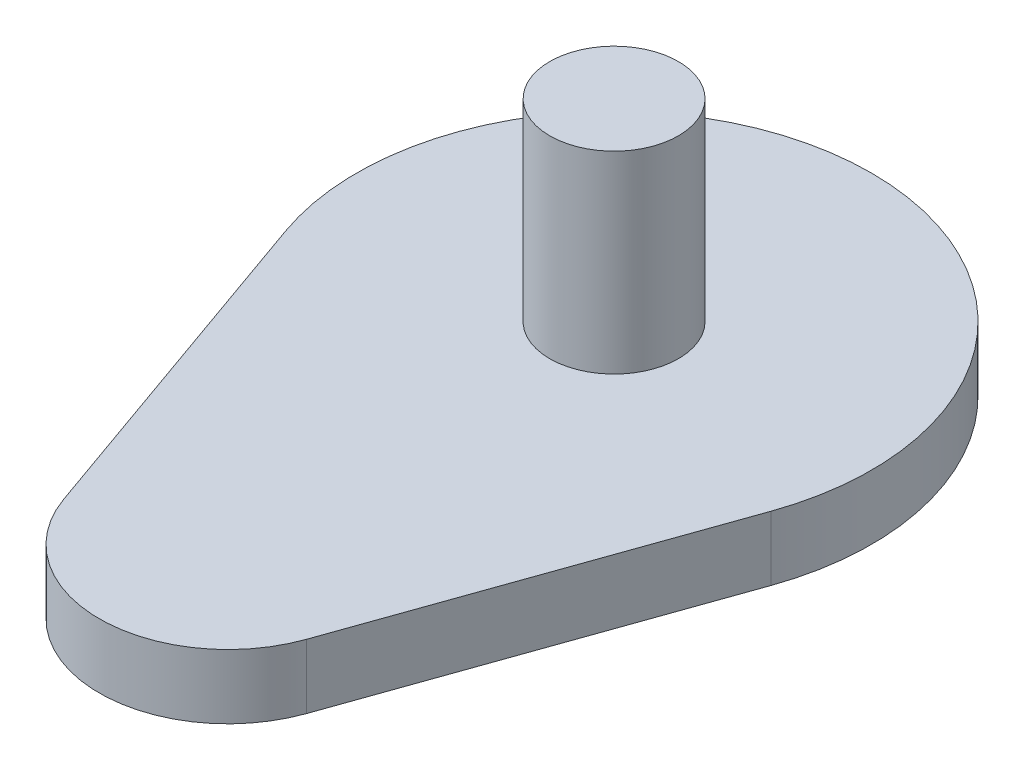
ISO-10303-21;
HEADER;
FILE_DESCRIPTION(('STEP AP214'),'2;1');
FILE_NAME('part.step','',(''),(''),'','','');
FILE_SCHEMA(('AUTOMOTIVE_DESIGN { 1 0 10303 214 1 1 1 1 }'));
ENDSEC;
DATA;
#1=APPLICATION_CONTEXT('core data for automotive mechanical design processes');
#2=APPLICATION_PROTOCOL_DEFINITION('international standard','automotive_design',2000,#1);
#3=PRODUCT_CONTEXT('',#1,'mechanical');
#4=PRODUCT('Part','Part','',(#3));
#5=PRODUCT_RELATED_PRODUCT_CATEGORY('part','',(#4));
#6=PRODUCT_DEFINITION_FORMATION('','',#4);
#7=PRODUCT_DEFINITION_CONTEXT('part definition',#1,'design');
#8=PRODUCT_DEFINITION('design','',#6,#7);
#9=PRODUCT_DEFINITION_SHAPE('','',#8);
#10=(LENGTH_UNIT() NAMED_UNIT(*) SI_UNIT(.MILLI.,.METRE.));
#11=(NAMED_UNIT(*) PLANE_ANGLE_UNIT() SI_UNIT($,.RADIAN.));
#12=(NAMED_UNIT(*) SI_UNIT($,.STERADIAN.) SOLID_ANGLE_UNIT());
#13=UNCERTAINTY_MEASURE_WITH_UNIT(LENGTH_MEASURE(1.E-05),#10,'distance_accuracy_value','');
#14=(GEOMETRIC_REPRESENTATION_CONTEXT(3) GLOBAL_UNCERTAINTY_ASSIGNED_CONTEXT((#13)) GLOBAL_UNIT_ASSIGNED_CONTEXT((#10,
#11,#12)) REPRESENTATION_CONTEXT('',''));
#15=CARTESIAN_POINT('',(0.,0.,0.));
#16=DIRECTION('',(0.,0.,1.));
#17=DIRECTION('',(1.,0.,0.));
#18=AXIS2_PLACEMENT_3D('',#15,#16,#17);
#19=CARTESIAN_POINT('',(0.,-19.142135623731,0.));
#20=DIRECTION('',(0.,1.,0.));
#21=DIRECTION('',(0.,0.,1.));
#22=AXIS2_PLACEMENT_3D('',#19,#20,#21);
#23=CYLINDRICAL_SURFACE('',#22,5.);
#24=CARTESIAN_POINT('',(0.,-5.,0.));
#25=DIRECTION('',(0.,1.,0.));
#26=DIRECTION('',(0.,0.,1.));
#27=AXIS2_PLACEMENT_3D('',#24,#25,#26);
#28=CIRCLE('',#27,5.);
#29=CARTESIAN_POINT('',(0.,-5.,5.));
#30=VERTEX_POINT('',#29);
#31=EDGE_CURVE('E11',#30,#30,#28,.F.);
#32=ORIENTED_EDGE('',*,*,#31,.F.);
#33=EDGE_LOOP('',(#32));
#34=FACE_BOUND('',#33,.T.);
#35=CARTESIAN_POINT('',(0.,15.,0.));
#36=DIRECTION('',(0.,1.,0.));
#37=DIRECTION('',(0.,0.,1.));
#38=AXIS2_PLACEMENT_3D('',#35,#36,#37);
#39=CIRCLE('',#38,5.);
#40=CARTESIAN_POINT('',(0.,15.,5.));
#41=VERTEX_POINT('',#40);
#42=EDGE_CURVE('E45',#41,#41,#39,.T.);
#43=ORIENTED_EDGE('',*,*,#42,.F.);
#44=EDGE_LOOP('',(#43));
#45=FACE_BOUND('',#44,.T.);
#46=ADVANCED_FACE('F39',(#34,#45),#23,.T.);
#47=CARTESIAN_POINT('',(0.,-5.,0.));
#48=DIRECTION('',(0.,1.,0.));
#49=DIRECTION('',(0.,0.,1.));
#50=AXIS2_PLACEMENT_3D('',#47,#48,#49);
#51=PLANE('',#50);
#52=ORIENTED_EDGE('',*,*,#31,.T.);
#53=EDGE_LOOP('',(#52));
#54=FACE_BOUND('',#53,.T.);
#55=ADVANCED_FACE('F54',(#54),#51,.F.);
#56=CARTESIAN_POINT('',(-56.230636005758,15.,9.99999999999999));
#57=DIRECTION('',(0.,1.,0.));
#58=DIRECTION('',(0.,0.,1.));
#59=AXIS2_PLACEMENT_3D('',#56,#57,#58);
#60=PLANE('',#59);
#61=ORIENTED_EDGE('',*,*,#42,.T.);
#62=EDGE_LOOP('',(#61));
#63=FACE_BOUND('',#62,.T.);
#64=ADVANCED_FACE('F51',(#63),#60,.T.);
#65=CLOSED_SHELL('',(#46,#55,#64));
#66=MANIFOLD_SOLID_BREP('B2',#65);
#67=CARTESIAN_POINT('',(0.,-5.,0.));
#68=DIRECTION('',(0.,1.,0.));
#69=DIRECTION('',(0.,0.,1.));
#70=AXIS2_PLACEMENT_3D('',#67,#68,#69);
#71=CYLINDRICAL_SURFACE('',#70,20.);
#72=CARTESIAN_POINT('',(0.,0.,0.));
#73=DIRECTION('',(0.,1.,0.));
#74=DIRECTION('',(0.,0.,1.));
#75=AXIS2_PLACEMENT_3D('',#72,#73,#74);
#76=CIRCLE('',#75,20.);
#77=CARTESIAN_POINT('',(18.8561808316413,0.,6.66666666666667));
#78=VERTEX_POINT('',#77);
#79=CARTESIAN_POINT('',(-18.8561808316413,0.,6.66666666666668));
#80=VERTEX_POINT('',#79);
#81=EDGE_CURVE('E145',#78,#80,#76,.T.);
#82=ORIENTED_EDGE('',*,*,#81,.F.);
#83=DIRECTION('',(0.,1.,0.));
#84=VECTOR('',#83,1.);
#85=CARTESIAN_POINT('',(18.8561808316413,-5.,6.66666666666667));
#86=LINE('',#85,#84);
#87=CARTESIAN_POINT('',(18.8561808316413,-5.,6.66666666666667));
#88=VERTEX_POINT('',#87);
#89=EDGE_CURVE('E37',#88,#78,#86,.T.);
#90=ORIENTED_EDGE('',*,*,#89,.F.);
#91=CARTESIAN_POINT('',(0.,-5.,0.));
#92=DIRECTION('',(0.,1.,0.));
#93=DIRECTION('',(0.,0.,1.));
#94=AXIS2_PLACEMENT_3D('',#91,#92,#93);
#95=CIRCLE('',#94,20.);
#96=CARTESIAN_POINT('',(-18.8561808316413,-5.,6.66666666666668));
#97=VERTEX_POINT('',#96);
#98=EDGE_CURVE('E138',#88,#97,#95,.T.);
#99=ORIENTED_EDGE('',*,*,#98,.T.);
#100=DIRECTION('',(0.,1.,0.));
#101=VECTOR('',#100,1.);
#102=CARTESIAN_POINT('',(-18.8561808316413,-5.,6.66666666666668));
#103=LINE('',#102,#101);
#104=EDGE_CURVE('E83',#97,#80,#103,.T.);
#105=ORIENTED_EDGE('',*,*,#104,.T.);
#106=EDGE_LOOP('',(#82,#90,#99,#105));
#107=FACE_BOUND('',#106,.T.);
#108=ADVANCED_FACE('F80',(#107),#71,.T.);
#109=CARTESIAN_POINT('',(18.8561808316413,-5.,6.66666666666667));
#110=DIRECTION('',(0.942809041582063,0.,0.333333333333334));
#111=DIRECTION('',(0.333333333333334,0.,-0.942809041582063));
#112=AXIS2_PLACEMENT_3D('',#109,#110,#111);
#113=PLANE('',#112);
#114=DIRECTION('',(0.333333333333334,0.,-0.942809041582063));
#115=VECTOR('',#114,1.);
#116=CARTESIAN_POINT('',(18.8561808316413,0.,6.66666666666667));
#117=LINE('',#116,#115);
#118=CARTESIAN_POINT('',(9.42809041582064,0.,33.3333333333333));
#119=VERTEX_POINT('',#118);
#120=EDGE_CURVE('E140',#119,#78,#117,.T.);
#121=ORIENTED_EDGE('',*,*,#120,.F.);
#122=DIRECTION('',(0.,1.,0.));
#123=VECTOR('',#122,1.);
#124=CARTESIAN_POINT('',(9.42809041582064,-5.,33.3333333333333));
#125=LINE('',#124,#123);
#126=CARTESIAN_POINT('',(9.42809041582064,-5.,33.3333333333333));
#127=VERTEX_POINT('',#126);
#128=EDGE_CURVE('E89',#127,#119,#125,.T.);
#129=ORIENTED_EDGE('',*,*,#128,.F.);
#130=DIRECTION('',(0.333333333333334,0.,-0.942809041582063));
#131=VECTOR('',#130,1.);
#132=CARTESIAN_POINT('',(18.8561808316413,-5.,6.66666666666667));
#133=LINE('',#132,#131);
#134=EDGE_CURVE('E135',#127,#88,#133,.T.);
#135=ORIENTED_EDGE('',*,*,#134,.T.);
#136=ORIENTED_EDGE('',*,*,#89,.T.);
#137=EDGE_LOOP('',(#121,#129,#135,#136));
#138=FACE_BOUND('',#137,.T.);
#139=ADVANCED_FACE('F156',(#138),#113,.T.);
#140=CARTESIAN_POINT('',(0.,-5.,30.));
#141=DIRECTION('',(0.,1.,0.));
#142=DIRECTION('',(0.,0.,1.));
#143=AXIS2_PLACEMENT_3D('',#140,#141,#142);
#144=CYLINDRICAL_SURFACE('',#143,10.);
#145=CARTESIAN_POINT('',(0.,0.,30.));
#146=DIRECTION('',(0.,1.,0.));
#147=DIRECTION('',(0.,0.,1.));
#148=AXIS2_PLACEMENT_3D('',#145,#146,#147);
#149=CIRCLE('',#148,10.);
#150=CARTESIAN_POINT('',(-9.42809041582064,0.,33.3333333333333));
#151=VERTEX_POINT('',#150);
#152=EDGE_CURVE('E130',#151,#119,#149,.T.);
#153=ORIENTED_EDGE('',*,*,#152,.F.);
#154=DIRECTION('',(0.,1.,0.));
#155=VECTOR('',#154,1.);
#156=CARTESIAN_POINT('',(-9.42809041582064,-5.,33.3333333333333));
#157=LINE('',#156,#155);
#158=CARTESIAN_POINT('',(-9.42809041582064,-5.,33.3333333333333));
#159=VERTEX_POINT('',#158);
#160=EDGE_CURVE('E125',#159,#151,#157,.T.);
#161=ORIENTED_EDGE('',*,*,#160,.F.);
#162=CARTESIAN_POINT('',(0.,-5.,30.));
#163=DIRECTION('',(0.,1.,0.));
#164=DIRECTION('',(0.,0.,1.));
#165=AXIS2_PLACEMENT_3D('',#162,#163,#164);
#166=CIRCLE('',#165,10.);
#167=EDGE_CURVE('E128',#159,#127,#166,.T.);
#168=ORIENTED_EDGE('',*,*,#167,.T.);
#169=ORIENTED_EDGE('',*,*,#128,.T.);
#170=EDGE_LOOP('',(#153,#161,#168,#169));
#171=FACE_BOUND('',#170,.T.);
#172=ADVANCED_FACE('F127',(#171),#144,.T.);
#173=CARTESIAN_POINT('',(-9.42809041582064,-5.,33.3333333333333));
#174=DIRECTION('',(-0.942809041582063,0.,0.333333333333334));
#175=DIRECTION('',(0.333333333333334,0.,0.942809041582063));
#176=AXIS2_PLACEMENT_3D('',#173,#174,#175);
#177=PLANE('',#176);
#178=DIRECTION('',(0.333333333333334,0.,0.942809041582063));
#179=VECTOR('',#178,1.);
#180=CARTESIAN_POINT('',(-9.42809041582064,0.,33.3333333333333));
#181=LINE('',#180,#179);
#182=EDGE_CURVE('E148',#80,#151,#181,.T.);
#183=ORIENTED_EDGE('',*,*,#182,.F.);
#184=ORIENTED_EDGE('',*,*,#104,.F.);
#185=DIRECTION('',(0.333333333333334,0.,0.942809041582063));
#186=VECTOR('',#185,1.);
#187=CARTESIAN_POINT('',(-9.42809041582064,-5.,33.3333333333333));
#188=LINE('',#187,#186);
#189=EDGE_CURVE('E134',#97,#159,#188,.T.);
#190=ORIENTED_EDGE('',*,*,#189,.T.);
#191=ORIENTED_EDGE('',*,*,#160,.T.);
#192=EDGE_LOOP('',(#183,#184,#190,#191));
#193=FACE_BOUND('',#192,.T.);
#194=ADVANCED_FACE('F137',(#193),#177,.T.);
#195=CARTESIAN_POINT('',(0.,-5.,0.));
#196=DIRECTION('',(0.,1.,0.));
#197=DIRECTION('',(0.,0.,1.));
#198=AXIS2_PLACEMENT_3D('',#195,#196,#197);
#199=PLANE('',#198);
#200=CARTESIAN_POINT('',(0.,-5.,0.));
#201=DIRECTION('',(0.,1.,0.));
#202=DIRECTION('',(0.,0.,1.));
#203=AXIS2_PLACEMENT_3D('',#200,#201,#202);
#204=CIRCLE('',#203,5.);
#205=CARTESIAN_POINT('',(0.,-5.,5.));
#206=VERTEX_POINT('',#205);
#207=EDGE_CURVE('E149',#206,#206,#204,.T.);
#208=ORIENTED_EDGE('',*,*,#207,.T.);
#209=EDGE_LOOP('',(#208));
#210=FACE_BOUND('',#209,.T.);
#211=ORIENTED_EDGE('',*,*,#98,.F.);
#212=ORIENTED_EDGE('',*,*,#134,.F.);
#213=ORIENTED_EDGE('',*,*,#167,.F.);
#214=ORIENTED_EDGE('',*,*,#189,.F.);
#215=EDGE_LOOP('',(#211,#212,#213,#214));
#216=FACE_BOUND('',#215,.T.);
#217=ADVANCED_FACE('F133',(#210,#216),#199,.F.);
#218=CARTESIAN_POINT('',(0.,0.,0.));
#219=DIRECTION('',(0.,1.,0.));
#220=DIRECTION('',(0.,0.,1.));
#221=AXIS2_PLACEMENT_3D('',#218,#219,#220);
#222=PLANE('',#221);
#223=CARTESIAN_POINT('',(0.,0.,0.));
#224=DIRECTION('',(0.,1.,0.));
#225=DIRECTION('',(0.,0.,1.));
#226=AXIS2_PLACEMENT_3D('',#223,#224,#225);
#227=CIRCLE('',#226,5.);
#228=CARTESIAN_POINT('',(0.,0.,5.));
#229=VERTEX_POINT('',#228);
#230=EDGE_CURVE('E186',#229,#229,#227,.T.);
#231=ORIENTED_EDGE('',*,*,#230,.F.);
#232=EDGE_LOOP('',(#231));
#233=FACE_BOUND('',#232,.T.);
#234=ORIENTED_EDGE('',*,*,#81,.T.);
#235=ORIENTED_EDGE('',*,*,#182,.T.);
#236=ORIENTED_EDGE('',*,*,#152,.T.);
#237=ORIENTED_EDGE('',*,*,#120,.T.);
#238=EDGE_LOOP('',(#234,#235,#236,#237));
#239=FACE_BOUND('',#238,.T.);
#240=ADVANCED_FACE('F155',(#233,#239),#222,.T.);
#241=CARTESIAN_POINT('',(0.,-5.,0.));
#242=DIRECTION('',(0.,1.,0.));
#243=DIRECTION('',(0.,0.,1.));
#244=AXIS2_PLACEMENT_3D('',#241,#242,#243);
#245=CYLINDRICAL_SURFACE('',#244,5.);
#246=ORIENTED_EDGE('',*,*,#207,.F.);
#247=EDGE_LOOP('',(#246));
#248=FACE_BOUND('',#247,.T.);
#249=ORIENTED_EDGE('',*,*,#230,.T.);
#250=EDGE_LOOP('',(#249));
#251=FACE_BOUND('',#250,.T.);
#252=ADVANCED_FACE('F174',(#248,#251),#245,.F.);
#253=CLOSED_SHELL('',(#108,#139,#172,#194,#217,#240,#252));
#254=MANIFOLD_SOLID_BREP('B6',#253);
#255=ADVANCED_BREP_SHAPE_REPRESENTATION('',(#18,#66,#254),#14);
#256=SHAPE_DEFINITION_REPRESENTATION(#9,#255);
ENDSEC;
END-ISO-10303-21;
